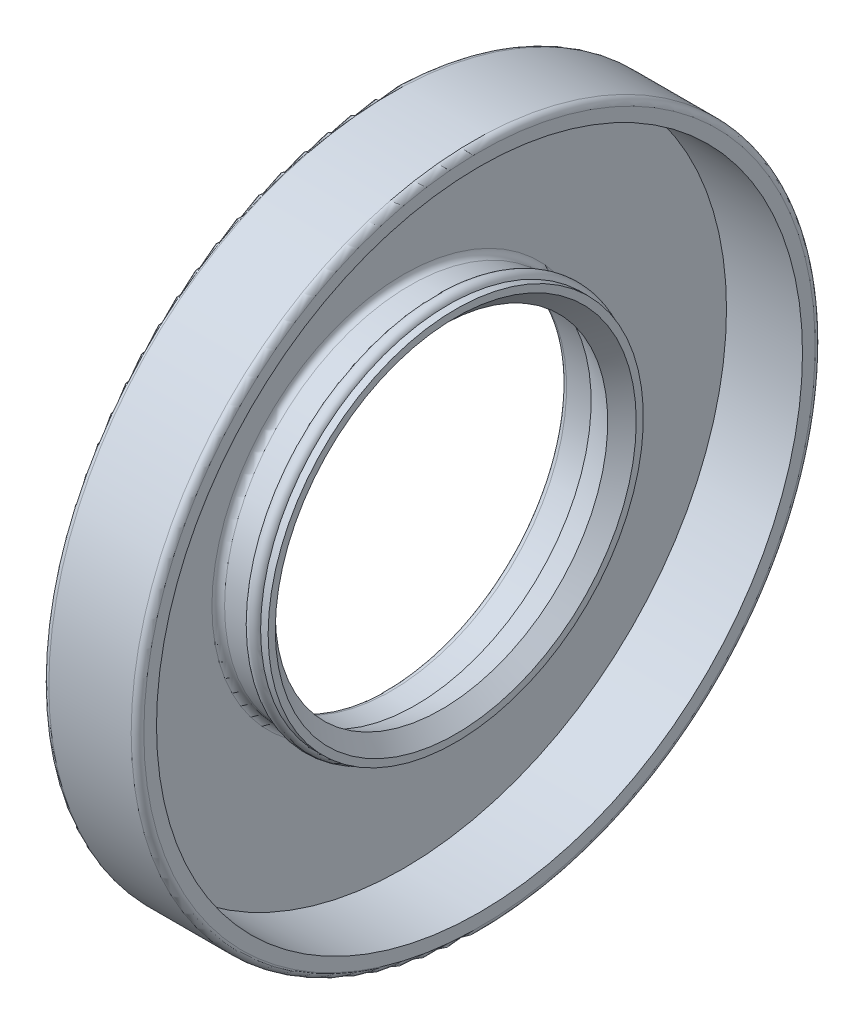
from build123d import *


with BuildPart() as part:
    # Esquisse1 → Base-R_volution (revolve)
    with BuildSketch(Plane(origin=(0, 0, 0), x_dir=(1, 0, 0), z_dir=(0, 1, 0)), mode=Mode.PRIVATE) as base_r_volution_sk:
        with BuildLine():
            Line((0, 19.166666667), (0, 35.333333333))
            ThreePointArc((0, 35.333333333), (0.195262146, 35.804737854), (0.666666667, 36))
            Line((0.666666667, 36), (9.333333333, 36))
            ThreePointArc((9.333333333, 36), (9.804737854, 35.804737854), (10, 35.333333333))
            Line((10, 35.333333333), (10, 34))
            Line((10, 34), (2, 34))
            Line((2, 34), (2, 20.166666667))
            ThreePointArc((2, 20.166666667), (2.195262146, 19.695262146), (2.666666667, 19.5))
            Line((2.666666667, 19.5), (5.25, 19.5))
            ThreePointArc((5.25, 19.5), (5.873173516, 20.23919892), (6.707106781, 19.75))
            Line((6.707106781, 19.75), (7.5, 19.75))
            Line((7.5, 19.75), (7.5, 19))
            Line((7.5, 19), (6, 17.5))
            Line((6, 17.5), (3.252522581, 18.5))
            Line((3.252522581, 18.5), (0.666666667, 18.5))
            ThreePointArc((0.666666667, 18.5), (0.195262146, 18.695262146), (0, 19.166666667))
        make_face()
    revolve(base_r_volution_sk.sketch.rotate(Axis((0, 0, 0), (1, 0, 0)), 180), axis=Axis((0, 0, 0), (1, 0, 0)))


solid = part.part
